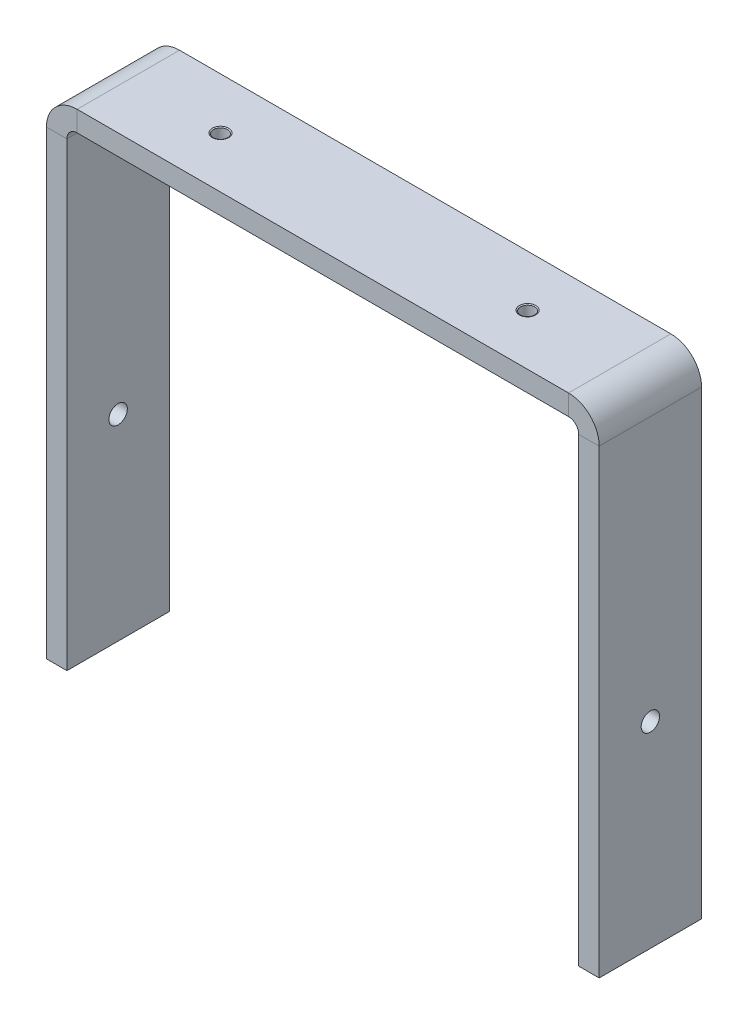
ISO-10303-21;
HEADER;
FILE_DESCRIPTION(('STEP AP214'),'2;1');
FILE_NAME('part.step','',(''),(''),'','','');
FILE_SCHEMA(('AUTOMOTIVE_DESIGN { 1 0 10303 214 1 1 1 1 }'));
ENDSEC;
DATA;
#1=APPLICATION_CONTEXT('core data for automotive mechanical design processes');
#2=APPLICATION_PROTOCOL_DEFINITION('international standard','automotive_design',2000,#1);
#3=PRODUCT_CONTEXT('',#1,'mechanical');
#4=PRODUCT('Part','Part','',(#3));
#5=PRODUCT_RELATED_PRODUCT_CATEGORY('part','',(#4));
#6=PRODUCT_DEFINITION_FORMATION('','',#4);
#7=PRODUCT_DEFINITION_CONTEXT('part definition',#1,'design');
#8=PRODUCT_DEFINITION('design','',#6,#7);
#9=PRODUCT_DEFINITION_SHAPE('','',#8);
#10=(LENGTH_UNIT() NAMED_UNIT(*) SI_UNIT(.MILLI.,.METRE.));
#11=(NAMED_UNIT(*) PLANE_ANGLE_UNIT() SI_UNIT($,.RADIAN.));
#12=(NAMED_UNIT(*) SI_UNIT($,.STERADIAN.) SOLID_ANGLE_UNIT());
#13=UNCERTAINTY_MEASURE_WITH_UNIT(LENGTH_MEASURE(1.E-05),#10,'distance_accuracy_value','');
#14=(GEOMETRIC_REPRESENTATION_CONTEXT(3) GLOBAL_UNCERTAINTY_ASSIGNED_CONTEXT((#13)) GLOBAL_UNIT_ASSIGNED_CONTEXT((#10,
#11,#12)) REPRESENTATION_CONTEXT('',''));
#15=CARTESIAN_POINT('',(0.,0.,0.));
#16=DIRECTION('',(0.,0.,1.));
#17=DIRECTION('',(1.,0.,0.));
#18=AXIS2_PLACEMENT_3D('',#15,#16,#17);
#19=CARTESIAN_POINT('',(135.,240.,25.));
#20=DIRECTION('',(1.,0.,0.));
#21=DIRECTION('',(0.,1.,0.));
#22=AXIS2_PLACEMENT_3D('',#19,#20,#21);
#23=PLANE('',#22);
#24=DIRECTION('',(0.,0.,-1.));
#25=VECTOR('',#24,1.);
#26=CARTESIAN_POINT('',(135.,225.,-25.));
#27=LINE('',#26,#25);
#28=CARTESIAN_POINT('',(135.,225.,25.));
#29=VERTEX_POINT('',#28);
#30=CARTESIAN_POINT('',(135.,225.,-25.));
#31=VERTEX_POINT('',#30);
#32=EDGE_CURVE('E209',#29,#31,#27,.T.);
#33=ORIENTED_EDGE('',*,*,#32,.F.);
#34=DIRECTION('',(0.,1.,0.));
#35=VECTOR('',#34,1.);
#36=CARTESIAN_POINT('',(135.,240.,25.));
#37=LINE('',#36,#35);
#38=CARTESIAN_POINT('',(135.,0.,25.));
#39=VERTEX_POINT('',#38);
#40=EDGE_CURVE('E11',#39,#29,#37,.T.);
#41=ORIENTED_EDGE('',*,*,#40,.F.);
#42=DIRECTION('',(0.,0.,-1.));
#43=VECTOR('',#42,1.);
#44=CARTESIAN_POINT('',(135.,0.,25.));
#45=LINE('',#44,#43);
#46=CARTESIAN_POINT('',(135.,0.,-25.));
#47=VERTEX_POINT('',#46);
#48=EDGE_CURVE('E204',#39,#47,#45,.T.);
#49=ORIENTED_EDGE('',*,*,#48,.T.);
#50=DIRECTION('',(0.,-1.,0.));
#51=VECTOR('',#50,1.);
#52=CARTESIAN_POINT('',(135.,240.,-25.));
#53=LINE('',#52,#51);
#54=EDGE_CURVE('E201',#31,#47,#53,.T.);
#55=ORIENTED_EDGE('',*,*,#54,.F.);
#56=EDGE_LOOP('',(#33,#41,#49,#55));
#57=FACE_BOUND('',#56,.T.);
#58=CARTESIAN_POINT('',(135.,96.,0.));
#59=DIRECTION('',(1.,0.,0.));
#60=DIRECTION('',(0.,0.,-1.));
#61=AXIS2_PLACEMENT_3D('',#58,#59,#60);
#62=CIRCLE('',#61,4.5);
#63=CARTESIAN_POINT('',(135.,96.,-4.5));
#64=VERTEX_POINT('',#63);
#65=EDGE_CURVE('E198',#64,#64,#62,.T.);
#66=ORIENTED_EDGE('',*,*,#65,.F.);
#67=EDGE_LOOP('',(#66));
#68=FACE_BOUND('',#67,.T.);
#69=ADVANCED_FACE('F28',(#57,#68),#23,.T.);
#70=CARTESIAN_POINT('',(-135.,96.0000000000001,0.));
#71=DIRECTION('',(1.,0.,0.));
#72=DIRECTION('',(0.,0.,-1.));
#73=AXIS2_PLACEMENT_3D('',#70,#71,#72);
#74=CYLINDRICAL_SURFACE('',#73,4.5);
#75=ORIENTED_EDGE('',*,*,#65,.T.);
#76=EDGE_LOOP('',(#75));
#77=FACE_BOUND('',#76,.T.);
#78=CARTESIAN_POINT('',(125.,96.,0.));
#79=DIRECTION('',(1.,0.,0.));
#80=DIRECTION('',(0.,1.,0.));
#81=AXIS2_PLACEMENT_3D('',#78,#79,#80);
#82=CIRCLE('',#81,4.5);
#83=CARTESIAN_POINT('',(125.,100.5,0.));
#84=VERTEX_POINT('',#83);
#85=EDGE_CURVE('E191',#84,#84,#82,.T.);
#86=ORIENTED_EDGE('',*,*,#85,.F.);
#87=EDGE_LOOP('',(#86));
#88=FACE_BOUND('',#87,.T.);
#89=ADVANCED_FACE('F311',(#77,#88),#74,.F.);
#90=CARTESIAN_POINT('',(125.,240.,25.));
#91=DIRECTION('',(1.,0.,0.));
#92=DIRECTION('',(0.,1.,0.));
#93=AXIS2_PLACEMENT_3D('',#90,#91,#92);
#94=PLANE('',#93);
#95=ORIENTED_EDGE('',*,*,#85,.T.);
#96=EDGE_LOOP('',(#95));
#97=FACE_BOUND('',#96,.T.);
#98=DIRECTION('',(0.,1.,0.));
#99=VECTOR('',#98,1.);
#100=CARTESIAN_POINT('',(125.,240.,25.));
#101=LINE('',#100,#99);
#102=CARTESIAN_POINT('',(125.,0.,25.));
#103=VERTEX_POINT('',#102);
#104=CARTESIAN_POINT('',(125.,225.,25.));
#105=VERTEX_POINT('',#104);
#106=EDGE_CURVE('E36',#103,#105,#101,.T.);
#107=ORIENTED_EDGE('',*,*,#106,.T.);
#108=DIRECTION('',(0.,0.,-1.));
#109=VECTOR('',#108,1.);
#110=CARTESIAN_POINT('',(125.,225.,-25.));
#111=LINE('',#110,#109);
#112=CARTESIAN_POINT('',(125.,225.,-25.));
#113=VERTEX_POINT('',#112);
#114=EDGE_CURVE('E206',#105,#113,#111,.T.);
#115=ORIENTED_EDGE('',*,*,#114,.T.);
#116=DIRECTION('',(0.,-1.,0.));
#117=VECTOR('',#116,1.);
#118=CARTESIAN_POINT('',(125.,240.,-25.));
#119=LINE('',#118,#117);
#120=CARTESIAN_POINT('',(125.,0.,-25.));
#121=VERTEX_POINT('',#120);
#122=EDGE_CURVE('E194',#113,#121,#119,.T.);
#123=ORIENTED_EDGE('',*,*,#122,.T.);
#124=DIRECTION('',(0.,0.,-1.));
#125=VECTOR('',#124,1.);
#126=CARTESIAN_POINT('',(125.,0.,25.));
#127=LINE('',#126,#125);
#128=EDGE_CURVE('E43',#103,#121,#127,.T.);
#129=ORIENTED_EDGE('',*,*,#128,.F.);
#130=EDGE_LOOP('',(#107,#115,#123,#129));
#131=FACE_BOUND('',#130,.T.);
#132=ADVANCED_FACE('F219',(#97,#131),#94,.F.);
#133=CARTESIAN_POINT('',(-335.977222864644,240.,-25.));
#134=DIRECTION('',(0.,0.,1.));
#135=DIRECTION('',(-1.,0.,0.));
#136=AXIS2_PLACEMENT_3D('',#133,#134,#135);
#137=PLANE('',#136);
#138=ORIENTED_EDGE('',*,*,#54,.T.);
#139=DIRECTION('',(1.,0.,0.));
#140=VECTOR('',#139,1.);
#141=CARTESIAN_POINT('',(-335.977222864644,0.,-25.));
#142=LINE('',#141,#140);
#143=EDGE_CURVE('E216',#121,#47,#142,.T.);
#144=ORIENTED_EDGE('',*,*,#143,.F.);
#145=ORIENTED_EDGE('',*,*,#122,.F.);
#146=DIRECTION('',(1.,0.,0.));
#147=VECTOR('',#146,1.);
#148=CARTESIAN_POINT('',(-335.977222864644,225.,-25.));
#149=LINE('',#148,#147);
#150=EDGE_CURVE('E125',#113,#31,#149,.T.);
#151=ORIENTED_EDGE('',*,*,#150,.T.);
#152=EDGE_LOOP('',(#138,#144,#145,#151));
#153=FACE_BOUND('',#152,.T.);
#154=ADVANCED_FACE('F30',(#153),#137,.F.);
#155=CARTESIAN_POINT('',(-335.977222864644,0.,25.));
#156=DIRECTION('',(0.,-1.,0.));
#157=DIRECTION('',(1.,0.,0.));
#158=AXIS2_PLACEMENT_3D('',#155,#156,#157);
#159=PLANE('',#158);
#160=ORIENTED_EDGE('',*,*,#143,.T.);
#161=ORIENTED_EDGE('',*,*,#48,.F.);
#162=DIRECTION('',(1.,0.,0.));
#163=VECTOR('',#162,1.);
#164=CARTESIAN_POINT('',(-335.977222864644,0.,25.));
#165=LINE('',#164,#163);
#166=EDGE_CURVE('E214',#103,#39,#165,.T.);
#167=ORIENTED_EDGE('',*,*,#166,.F.);
#168=ORIENTED_EDGE('',*,*,#128,.T.);
#169=EDGE_LOOP('',(#160,#161,#167,#168));
#170=FACE_BOUND('',#169,.T.);
#171=ADVANCED_FACE('F223',(#170),#159,.T.);
#172=CARTESIAN_POINT('',(-335.977222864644,240.,25.));
#173=DIRECTION('',(0.,0.,1.));
#174=DIRECTION('',(-1.,0.,0.));
#175=AXIS2_PLACEMENT_3D('',#172,#173,#174);
#176=PLANE('',#175);
#177=ORIENTED_EDGE('',*,*,#166,.T.);
#178=ORIENTED_EDGE('',*,*,#40,.T.);
#179=DIRECTION('',(1.,0.,0.));
#180=VECTOR('',#179,1.);
#181=CARTESIAN_POINT('',(-335.977222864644,225.,25.));
#182=LINE('',#181,#180);
#183=EDGE_CURVE('E212',#105,#29,#182,.T.);
#184=ORIENTED_EDGE('',*,*,#183,.F.);
#185=ORIENTED_EDGE('',*,*,#106,.F.);
#186=EDGE_LOOP('',(#177,#178,#184,#185));
#187=FACE_BOUND('',#186,.T.);
#188=ADVANCED_FACE('F225',(#187),#176,.T.);
#189=CARTESIAN_POINT('',(-135.,240.,25.));
#190=DIRECTION('',(0.,1.,0.));
#191=DIRECTION('',(-1.,0.,0.));
#192=AXIS2_PLACEMENT_3D('',#189,#190,#191);
#193=PLANE('',#192);
#194=CARTESIAN_POINT('',(-75.0000000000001,240.,0.));
#195=DIRECTION('',(0.,1.,0.));
#196=DIRECTION('',(-1.,0.,0.));
#197=AXIS2_PLACEMENT_3D('',#194,#195,#196);
#198=CIRCLE('',#197,4.00000000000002);
#199=CARTESIAN_POINT('',(-79.0000000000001,240.,0.));
#200=VERTEX_POINT('',#199);
#201=EDGE_CURVE('E171',#200,#200,#198,.F.);
#202=ORIENTED_EDGE('',*,*,#201,.T.);
#203=EDGE_LOOP('',(#202));
#204=FACE_BOUND('',#203,.T.);
#205=CARTESIAN_POINT('',(74.9999999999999,240.,0.));
#206=DIRECTION('',(0.,1.,0.));
#207=DIRECTION('',(-1.,0.,0.));
#208=AXIS2_PLACEMENT_3D('',#205,#206,#207);
#209=CIRCLE('',#208,3.99999999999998);
#210=CARTESIAN_POINT('',(70.9999999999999,240.,0.));
#211=VERTEX_POINT('',#210);
#212=EDGE_CURVE('E168',#211,#211,#209,.F.);
#213=ORIENTED_EDGE('',*,*,#212,.T.);
#214=EDGE_LOOP('',(#213));
#215=FACE_BOUND('',#214,.T.);
#216=DIRECTION('',(1.,0.,0.));
#217=VECTOR('',#216,1.);
#218=CARTESIAN_POINT('',(-135.,240.,25.));
#219=LINE('',#218,#217);
#220=CARTESIAN_POINT('',(-120.,240.,25.));
#221=VERTEX_POINT('',#220);
#222=CARTESIAN_POINT('',(120.,240.,25.));
#223=VERTEX_POINT('',#222);
#224=EDGE_CURVE('E175',#221,#223,#219,.T.);
#225=ORIENTED_EDGE('',*,*,#224,.T.);
#226=DIRECTION('',(0.,0.,-1.));
#227=VECTOR('',#226,1.);
#228=CARTESIAN_POINT('',(120.,240.,-25.));
#229=LINE('',#228,#227);
#230=CARTESIAN_POINT('',(120.,240.,-25.));
#231=VERTEX_POINT('',#230);
#232=EDGE_CURVE('E139',#223,#231,#229,.T.);
#233=ORIENTED_EDGE('',*,*,#232,.T.);
#234=DIRECTION('',(1.,0.,0.));
#235=VECTOR('',#234,1.);
#236=CARTESIAN_POINT('',(-135.,240.,-25.));
#237=LINE('',#236,#235);
#238=CARTESIAN_POINT('',(-120.,240.,-25.));
#239=VERTEX_POINT('',#238);
#240=EDGE_CURVE('E150',#239,#231,#237,.T.);
#241=ORIENTED_EDGE('',*,*,#240,.F.);
#242=DIRECTION('',(0.,0.,-1.));
#243=VECTOR('',#242,1.);
#244=CARTESIAN_POINT('',(-120.,240.,-25.));
#245=LINE('',#244,#243);
#246=EDGE_CURVE('E188',#221,#239,#245,.T.);
#247=ORIENTED_EDGE('',*,*,#246,.F.);
#248=EDGE_LOOP('',(#225,#233,#241,#247));
#249=FACE_BOUND('',#248,.T.);
#250=ADVANCED_FACE('F308',(#204,#215,#249),#193,.T.);
#251=CARTESIAN_POINT('',(-135.,230.,25.));
#252=DIRECTION('',(0.,1.,0.));
#253=DIRECTION('',(-1.,0.,0.));
#254=AXIS2_PLACEMENT_3D('',#251,#252,#253);
#255=PLANE('',#254);
#256=CARTESIAN_POINT('',(-75.0000000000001,230.,0.));
#257=DIRECTION('',(0.,1.,0.));
#258=DIRECTION('',(-1.,0.,0.));
#259=AXIS2_PLACEMENT_3D('',#256,#257,#258);
#260=CIRCLE('',#259,3.45);
#261=CARTESIAN_POINT('',(-78.4500000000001,230.,0.));
#262=VERTEX_POINT('',#261);
#263=EDGE_CURVE('E157',#262,#262,#260,.T.);
#264=ORIENTED_EDGE('',*,*,#263,.T.);
#265=EDGE_LOOP('',(#264));
#266=FACE_BOUND('',#265,.T.);
#267=CARTESIAN_POINT('',(74.9999999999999,230.,0.));
#268=DIRECTION('',(0.,1.,0.));
#269=DIRECTION('',(-1.,0.,0.));
#270=AXIS2_PLACEMENT_3D('',#267,#268,#269);
#271=CIRCLE('',#270,3.45);
#272=CARTESIAN_POINT('',(71.5499999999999,230.,0.));
#273=VERTEX_POINT('',#272);
#274=EDGE_CURVE('E162',#273,#273,#271,.T.);
#275=ORIENTED_EDGE('',*,*,#274,.T.);
#276=EDGE_LOOP('',(#275));
#277=FACE_BOUND('',#276,.T.);
#278=DIRECTION('',(0.,0.,-1.));
#279=VECTOR('',#278,1.);
#280=CARTESIAN_POINT('',(120.,230.,-25.));
#281=LINE('',#280,#279);
#282=CARTESIAN_POINT('',(120.,230.,25.));
#283=VERTEX_POINT('',#282);
#284=CARTESIAN_POINT('',(120.,230.,-25.));
#285=VERTEX_POINT('',#284);
#286=EDGE_CURVE('E132',#283,#285,#281,.T.);
#287=ORIENTED_EDGE('',*,*,#286,.F.);
#288=DIRECTION('',(1.,0.,0.));
#289=VECTOR('',#288,1.);
#290=CARTESIAN_POINT('',(-135.,230.,25.));
#291=LINE('',#290,#289);
#292=CARTESIAN_POINT('',(-120.,230.,25.));
#293=VERTEX_POINT('',#292);
#294=EDGE_CURVE('E156',#293,#283,#291,.T.);
#295=ORIENTED_EDGE('',*,*,#294,.F.);
#296=DIRECTION('',(0.,0.,-1.));
#297=VECTOR('',#296,1.);
#298=CARTESIAN_POINT('',(-120.,230.,-25.));
#299=LINE('',#298,#297);
#300=CARTESIAN_POINT('',(-120.,230.,-25.));
#301=VERTEX_POINT('',#300);
#302=EDGE_CURVE('E152',#293,#301,#299,.T.);
#303=ORIENTED_EDGE('',*,*,#302,.T.);
#304=DIRECTION('',(1.,0.,0.));
#305=VECTOR('',#304,1.);
#306=CARTESIAN_POINT('',(-135.,230.,-25.));
#307=LINE('',#306,#305);
#308=EDGE_CURVE('E147',#301,#285,#307,.T.);
#309=ORIENTED_EDGE('',*,*,#308,.T.);
#310=EDGE_LOOP('',(#287,#295,#303,#309));
#311=FACE_BOUND('',#310,.T.);
#312=ADVANCED_FACE('F155',(#266,#277,#311),#255,.F.);
#313=CARTESIAN_POINT('',(-75.,0.,0.));
#314=DIRECTION('',(0.,1.,0.));
#315=DIRECTION('',(-1.,0.,0.));
#316=AXIS2_PLACEMENT_3D('',#313,#314,#315);
#317=CYLINDRICAL_SURFACE('',#316,3.45);
#318=CARTESIAN_POINT('',(-75.0000000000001,239.682457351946,0.));
#319=DIRECTION('',(0.,1.,0.));
#320=DIRECTION('',(0.,0.,1.));
#321=AXIS2_PLACEMENT_3D('',#318,#319,#320);
#322=CIRCLE('',#321,3.45);
#323=CARTESIAN_POINT('',(-75.0000000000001,239.682457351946,3.45));
#324=VERTEX_POINT('',#323);
#325=EDGE_CURVE('E140',#324,#324,#322,.T.);
#326=ORIENTED_EDGE('',*,*,#325,.T.);
#327=EDGE_LOOP('',(#326));
#328=FACE_BOUND('',#327,.T.);
#329=ORIENTED_EDGE('',*,*,#263,.F.);
#330=EDGE_LOOP('',(#329));
#331=FACE_BOUND('',#330,.T.);
#332=ADVANCED_FACE('F302',(#328,#331),#317,.F.);
#333=CARTESIAN_POINT('',(-75.0000000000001,239.682457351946,0.));
#334=DIRECTION('',(0.,1.,0.));
#335=DIRECTION('',(0.,0.,1.));
#336=AXIS2_PLACEMENT_3D('',#333,#334,#335);
#337=CONICAL_SURFACE('',#336,3.45,1.04719755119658);
#338=ORIENTED_EDGE('',*,*,#201,.F.);
#339=EDGE_LOOP('',(#338));
#340=FACE_BOUND('',#339,.T.);
#341=ORIENTED_EDGE('',*,*,#325,.F.);
#342=EDGE_LOOP('',(#341));
#343=FACE_BOUND('',#342,.T.);
#344=ADVANCED_FACE('F303',(#340,#343),#337,.F.);
#345=CARTESIAN_POINT('',(74.9999999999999,239.682457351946,0.));
#346=DIRECTION('',(0.,1.,0.));
#347=DIRECTION('',(0.,0.,1.));
#348=AXIS2_PLACEMENT_3D('',#345,#346,#347);
#349=CONICAL_SURFACE('',#348,3.45,1.04719755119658);
#350=ORIENTED_EDGE('',*,*,#212,.F.);
#351=EDGE_LOOP('',(#350));
#352=FACE_BOUND('',#351,.T.);
#353=CARTESIAN_POINT('',(74.9999999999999,239.682457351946,0.));
#354=DIRECTION('',(0.,1.,0.));
#355=DIRECTION('',(0.,0.,1.));
#356=AXIS2_PLACEMENT_3D('',#353,#354,#355);
#357=CIRCLE('',#356,3.45);
#358=CARTESIAN_POINT('',(74.9999999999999,239.682457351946,3.45));
#359=VERTEX_POINT('',#358);
#360=EDGE_CURVE('E159',#359,#359,#357,.T.);
#361=ORIENTED_EDGE('',*,*,#360,.F.);
#362=EDGE_LOOP('',(#361));
#363=FACE_BOUND('',#362,.T.);
#364=ADVANCED_FACE('F293',(#352,#363),#349,.F.);
#365=CARTESIAN_POINT('',(75.,0.,0.));
#366=DIRECTION('',(0.,1.,0.));
#367=DIRECTION('',(-1.,0.,0.));
#368=AXIS2_PLACEMENT_3D('',#365,#366,#367);
#369=CYLINDRICAL_SURFACE('',#368,3.45);
#370=ORIENTED_EDGE('',*,*,#360,.T.);
#371=EDGE_LOOP('',(#370));
#372=FACE_BOUND('',#371,.T.);
#373=ORIENTED_EDGE('',*,*,#274,.F.);
#374=EDGE_LOOP('',(#373));
#375=FACE_BOUND('',#374,.T.);
#376=ADVANCED_FACE('F291',(#372,#375),#369,.F.);
#377=CARTESIAN_POINT('',(-135.,-260.30602688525,-25.));
#378=DIRECTION('',(0.,0.,1.));
#379=DIRECTION('',(0.,-1.,0.));
#380=AXIS2_PLACEMENT_3D('',#377,#378,#379);
#381=PLANE('',#380);
#382=ORIENTED_EDGE('',*,*,#240,.T.);
#383=DIRECTION('',(0.,1.,0.));
#384=VECTOR('',#383,1.);
#385=CARTESIAN_POINT('',(120.,-260.30602688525,-25.));
#386=LINE('',#385,#384);
#387=EDGE_CURVE('E122',#285,#231,#386,.T.);
#388=ORIENTED_EDGE('',*,*,#387,.F.);
#389=ORIENTED_EDGE('',*,*,#308,.F.);
#390=DIRECTION('',(0.,1.,0.));
#391=VECTOR('',#390,1.);
#392=CARTESIAN_POINT('',(-120.,-260.30602688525,-25.));
#393=LINE('',#392,#391);
#394=EDGE_CURVE('E181',#301,#239,#393,.T.);
#395=ORIENTED_EDGE('',*,*,#394,.T.);
#396=EDGE_LOOP('',(#382,#388,#389,#395));
#397=FACE_BOUND('',#396,.T.);
#398=ADVANCED_FACE('F145',(#397),#381,.F.);
#399=CARTESIAN_POINT('',(-135.,-260.30602688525,25.));
#400=DIRECTION('',(0.,0.,1.));
#401=DIRECTION('',(0.,-1.,0.));
#402=AXIS2_PLACEMENT_3D('',#399,#400,#401);
#403=PLANE('',#402);
#404=DIRECTION('',(0.,1.,0.));
#405=VECTOR('',#404,1.);
#406=CARTESIAN_POINT('',(120.,-260.30602688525,25.));
#407=LINE('',#406,#405);
#408=EDGE_CURVE('E153',#283,#223,#407,.T.);
#409=ORIENTED_EDGE('',*,*,#408,.T.);
#410=ORIENTED_EDGE('',*,*,#224,.F.);
#411=DIRECTION('',(0.,1.,0.));
#412=VECTOR('',#411,1.);
#413=CARTESIAN_POINT('',(-120.,-260.30602688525,25.));
#414=LINE('',#413,#412);
#415=EDGE_CURVE('E183',#293,#221,#414,.T.);
#416=ORIENTED_EDGE('',*,*,#415,.F.);
#417=ORIENTED_EDGE('',*,*,#294,.T.);
#418=EDGE_LOOP('',(#409,#410,#416,#417));
#419=FACE_BOUND('',#418,.T.);
#420=ADVANCED_FACE('F300',(#419),#403,.T.);
#421=CARTESIAN_POINT('',(-135.,0.,25.));
#422=DIRECTION('',(-1.,0.,0.));
#423=DIRECTION('',(0.,0.,1.));
#424=AXIS2_PLACEMENT_3D('',#421,#422,#423);
#425=PLANE('',#424);
#426=CARTESIAN_POINT('',(-135.,96.,0.));
#427=DIRECTION('',(1.,0.,0.));
#428=DIRECTION('',(0.,0.,-1.));
#429=AXIS2_PLACEMENT_3D('',#426,#427,#428);
#430=CIRCLE('',#429,4.5);
#431=CARTESIAN_POINT('',(-135.,96.,-4.5));
#432=VERTEX_POINT('',#431);
#433=EDGE_CURVE('E261',#432,#432,#430,.T.);
#434=ORIENTED_EDGE('',*,*,#433,.T.);
#435=EDGE_LOOP('',(#434));
#436=FACE_BOUND('',#435,.T.);
#437=DIRECTION('',(0.,1.,0.));
#438=VECTOR('',#437,1.);
#439=CARTESIAN_POINT('',(-135.,0.,25.));
#440=LINE('',#439,#438);
#441=CARTESIAN_POINT('',(-135.,0.,25.));
#442=VERTEX_POINT('',#441);
#443=CARTESIAN_POINT('',(-135.,225.,25.));
#444=VERTEX_POINT('',#443);
#445=EDGE_CURVE('E269',#442,#444,#440,.T.);
#446=ORIENTED_EDGE('',*,*,#445,.T.);
#447=DIRECTION('',(0.,0.,-1.));
#448=VECTOR('',#447,1.);
#449=CARTESIAN_POINT('',(-135.,225.,-25.));
#450=LINE('',#449,#448);
#451=CARTESIAN_POINT('',(-135.,225.,-25.));
#452=VERTEX_POINT('',#451);
#453=EDGE_CURVE('E275',#444,#452,#450,.T.);
#454=ORIENTED_EDGE('',*,*,#453,.T.);
#455=DIRECTION('',(0.,1.,0.));
#456=VECTOR('',#455,1.);
#457=CARTESIAN_POINT('',(-135.,0.,-25.));
#458=LINE('',#457,#456);
#459=CARTESIAN_POINT('',(-135.,0.,-25.));
#460=VERTEX_POINT('',#459);
#461=EDGE_CURVE('E264',#460,#452,#458,.T.);
#462=ORIENTED_EDGE('',*,*,#461,.F.);
#463=DIRECTION('',(0.,0.,-1.));
#464=VECTOR('',#463,1.);
#465=CARTESIAN_POINT('',(-135.,0.,25.));
#466=LINE('',#465,#464);
#467=EDGE_CURVE('E267',#442,#460,#466,.T.);
#468=ORIENTED_EDGE('',*,*,#467,.F.);
#469=EDGE_LOOP('',(#446,#454,#462,#468));
#470=FACE_BOUND('',#469,.T.);
#471=ADVANCED_FACE('F377',(#436,#470),#425,.T.);
#472=CARTESIAN_POINT('',(-125.,0.,25.));
#473=DIRECTION('',(-1.,0.,0.));
#474=DIRECTION('',(0.,0.,1.));
#475=AXIS2_PLACEMENT_3D('',#472,#473,#474);
#476=PLANE('',#475);
#477=CARTESIAN_POINT('',(-125.,96.,0.));
#478=DIRECTION('',(-1.,0.,0.));
#479=DIRECTION('',(0.,0.,1.));
#480=AXIS2_PLACEMENT_3D('',#477,#478,#479);
#481=CIRCLE('',#480,4.5);
#482=CARTESIAN_POINT('',(-125.,96.,4.5));
#483=VERTEX_POINT('',#482);
#484=EDGE_CURVE('E250',#483,#483,#481,.T.);
#485=ORIENTED_EDGE('',*,*,#484,.T.);
#486=EDGE_LOOP('',(#485));
#487=FACE_BOUND('',#486,.T.);
#488=DIRECTION('',(0.,0.,-1.));
#489=VECTOR('',#488,1.);
#490=CARTESIAN_POINT('',(-125.,225.,-25.));
#491=LINE('',#490,#489);
#492=CARTESIAN_POINT('',(-125.,225.,25.));
#493=VERTEX_POINT('',#492);
#494=CARTESIAN_POINT('',(-125.,225.,-25.));
#495=VERTEX_POINT('',#494);
#496=EDGE_CURVE('E272',#493,#495,#491,.T.);
#497=ORIENTED_EDGE('',*,*,#496,.F.);
#498=DIRECTION('',(0.,1.,0.));
#499=VECTOR('',#498,1.);
#500=CARTESIAN_POINT('',(-125.,0.,25.));
#501=LINE('',#500,#499);
#502=CARTESIAN_POINT('',(-125.,0.,25.));
#503=VERTEX_POINT('',#502);
#504=EDGE_CURVE('E256',#503,#493,#501,.T.);
#505=ORIENTED_EDGE('',*,*,#504,.F.);
#506=DIRECTION('',(0.,0.,-1.));
#507=VECTOR('',#506,1.);
#508=CARTESIAN_POINT('',(-125.,0.,25.));
#509=LINE('',#508,#507);
#510=CARTESIAN_POINT('',(-125.,0.,-25.));
#511=VERTEX_POINT('',#510);
#512=EDGE_CURVE('E259',#503,#511,#509,.T.);
#513=ORIENTED_EDGE('',*,*,#512,.T.);
#514=DIRECTION('',(0.,1.,0.));
#515=VECTOR('',#514,1.);
#516=CARTESIAN_POINT('',(-125.,0.,-25.));
#517=LINE('',#516,#515);
#518=EDGE_CURVE('E253',#511,#495,#517,.T.);
#519=ORIENTED_EDGE('',*,*,#518,.T.);
#520=EDGE_LOOP('',(#497,#505,#513,#519));
#521=FACE_BOUND('',#520,.T.);
#522=ADVANCED_FACE('F384',(#487,#521),#476,.F.);
#523=CARTESIAN_POINT('',(-135.,96.,0.));
#524=DIRECTION('',(1.,0.,0.));
#525=DIRECTION('',(0.,0.,-1.));
#526=AXIS2_PLACEMENT_3D('',#523,#524,#525);
#527=CYLINDRICAL_SURFACE('',#526,4.5);
#528=ORIENTED_EDGE('',*,*,#433,.F.);
#529=EDGE_LOOP('',(#528));
#530=FACE_BOUND('',#529,.T.);
#531=ORIENTED_EDGE('',*,*,#484,.F.);
#532=EDGE_LOOP('',(#531));
#533=FACE_BOUND('',#532,.T.);
#534=ADVANCED_FACE('F392',(#530,#533),#527,.F.);
#535=CARTESIAN_POINT('',(335.977222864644,0.,-25.));
#536=DIRECTION('',(0.,0.,1.));
#537=DIRECTION('',(1.,0.,0.));
#538=AXIS2_PLACEMENT_3D('',#535,#536,#537);
#539=PLANE('',#538);
#540=ORIENTED_EDGE('',*,*,#461,.T.);
#541=DIRECTION('',(-1.,0.,0.));
#542=VECTOR('',#541,1.);
#543=CARTESIAN_POINT('',(335.977222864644,225.,-25.));
#544=LINE('',#543,#542);
#545=EDGE_CURVE('E286',#495,#452,#544,.T.);
#546=ORIENTED_EDGE('',*,*,#545,.F.);
#547=ORIENTED_EDGE('',*,*,#518,.F.);
#548=DIRECTION('',(-1.,0.,0.));
#549=VECTOR('',#548,1.);
#550=CARTESIAN_POINT('',(335.977222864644,0.,-25.));
#551=LINE('',#550,#549);
#552=EDGE_CURVE('E278',#511,#460,#551,.T.);
#553=ORIENTED_EDGE('',*,*,#552,.T.);
#554=EDGE_LOOP('',(#540,#546,#547,#553));
#555=FACE_BOUND('',#554,.T.);
#556=ADVANCED_FACE('F400',(#555),#539,.F.);
#557=CARTESIAN_POINT('',(335.977222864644,0.,25.));
#558=DIRECTION('',(0.,0.,1.));
#559=DIRECTION('',(1.,0.,0.));
#560=AXIS2_PLACEMENT_3D('',#557,#558,#559);
#561=PLANE('',#560);
#562=DIRECTION('',(-1.,0.,0.));
#563=VECTOR('',#562,1.);
#564=CARTESIAN_POINT('',(335.977222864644,225.,25.));
#565=LINE('',#564,#563);
#566=EDGE_CURVE('E283',#493,#444,#565,.T.);
#567=ORIENTED_EDGE('',*,*,#566,.T.);
#568=ORIENTED_EDGE('',*,*,#445,.F.);
#569=DIRECTION('',(-1.,0.,0.));
#570=VECTOR('',#569,1.);
#571=CARTESIAN_POINT('',(335.977222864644,0.,25.));
#572=LINE('',#571,#570);
#573=EDGE_CURVE('E281',#503,#442,#572,.T.);
#574=ORIENTED_EDGE('',*,*,#573,.F.);
#575=ORIENTED_EDGE('',*,*,#504,.T.);
#576=EDGE_LOOP('',(#567,#568,#574,#575));
#577=FACE_BOUND('',#576,.T.);
#578=ADVANCED_FACE('F408',(#577),#561,.T.);
#579=CARTESIAN_POINT('',(335.977222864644,0.,25.));
#580=DIRECTION('',(0.,1.,0.));
#581=DIRECTION('',(0.,0.,1.));
#582=AXIS2_PLACEMENT_3D('',#579,#580,#581);
#583=PLANE('',#582);
#584=ORIENTED_EDGE('',*,*,#467,.T.);
#585=ORIENTED_EDGE('',*,*,#552,.F.);
#586=ORIENTED_EDGE('',*,*,#512,.F.);
#587=ORIENTED_EDGE('',*,*,#573,.T.);
#588=EDGE_LOOP('',(#584,#585,#586,#587));
#589=FACE_BOUND('',#588,.T.);
#590=ADVANCED_FACE('F416',(#589),#583,.F.);
#591=CARTESIAN_POINT('',(-120.,225.,-25.));
#592=DIRECTION('',(0.,0.,-1.));
#593=DIRECTION('',(-1.,0.,0.));
#594=AXIS2_PLACEMENT_3D('',#591,#592,#593);
#595=PLANE('',#594);
#596=ORIENTED_EDGE('',*,*,#394,.F.);
#597=CARTESIAN_POINT('',(-120.,225.,-25.));
#598=DIRECTION('',(0.,0.,1.));
#599=DIRECTION('',(1.,0.,0.));
#600=AXIS2_PLACEMENT_3D('',#597,#598,#599);
#601=CIRCLE('',#600,5.00000000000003);
#602=EDGE_CURVE('E235',#301,#495,#601,.T.);
#603=ORIENTED_EDGE('',*,*,#602,.T.);
#604=ORIENTED_EDGE('',*,*,#545,.T.);
#605=CARTESIAN_POINT('',(-120.,225.,-25.));
#606=DIRECTION('',(0.,0.,1.));
#607=DIRECTION('',(1.,0.,0.));
#608=AXIS2_PLACEMENT_3D('',#605,#606,#607);
#609=CIRCLE('',#608,15.);
#610=EDGE_CURVE('E244',#239,#452,#609,.T.);
#611=ORIENTED_EDGE('',*,*,#610,.F.);
#612=EDGE_LOOP('',(#596,#603,#604,#611));
#613=FACE_BOUND('',#612,.T.);
#614=ADVANCED_FACE('F424',(#613),#595,.T.);
#615=CARTESIAN_POINT('',(-120.,225.,25.));
#616=DIRECTION('',(0.,0.,1.));
#617=DIRECTION('',(1.,0.,0.));
#618=AXIS2_PLACEMENT_3D('',#615,#616,#617);
#619=PLANE('',#618);
#620=CARTESIAN_POINT('',(-120.,225.,25.));
#621=DIRECTION('',(0.,0.,1.));
#622=DIRECTION('',(1.,0.,0.));
#623=AXIS2_PLACEMENT_3D('',#620,#621,#622);
#624=CIRCLE('',#623,5.00000000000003);
#625=EDGE_CURVE('E237',#493,#293,#624,.F.);
#626=ORIENTED_EDGE('',*,*,#625,.T.);
#627=ORIENTED_EDGE('',*,*,#415,.T.);
#628=CARTESIAN_POINT('',(-120.,225.,25.));
#629=DIRECTION('',(0.,0.,1.));
#630=DIRECTION('',(1.,0.,0.));
#631=AXIS2_PLACEMENT_3D('',#628,#629,#630);
#632=CIRCLE('',#631,15.);
#633=EDGE_CURVE('E247',#444,#221,#632,.F.);
#634=ORIENTED_EDGE('',*,*,#633,.F.);
#635=ORIENTED_EDGE('',*,*,#566,.F.);
#636=EDGE_LOOP('',(#626,#627,#634,#635));
#637=FACE_BOUND('',#636,.T.);
#638=ADVANCED_FACE('F432',(#637),#619,.T.);
#639=CARTESIAN_POINT('',(-120.,225.,-748.215693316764));
#640=DIRECTION('',(0.,0.,1.));
#641=DIRECTION('',(1.,0.,0.));
#642=AXIS2_PLACEMENT_3D('',#639,#640,#641);
#643=CYLINDRICAL_SURFACE('',#642,15.);
#644=ORIENTED_EDGE('',*,*,#453,.F.);
#645=ORIENTED_EDGE('',*,*,#633,.T.);
#646=ORIENTED_EDGE('',*,*,#246,.T.);
#647=ORIENTED_EDGE('',*,*,#610,.T.);
#648=EDGE_LOOP('',(#644,#645,#646,#647));
#649=FACE_BOUND('',#648,.T.);
#650=ADVANCED_FACE('F435',(#649),#643,.T.);
#651=CARTESIAN_POINT('',(-120.,225.,-748.215693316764));
#652=DIRECTION('',(0.,0.,1.));
#653=DIRECTION('',(1.,0.,0.));
#654=AXIS2_PLACEMENT_3D('',#651,#652,#653);
#655=CYLINDRICAL_SURFACE('',#654,5.00000000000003);
#656=ORIENTED_EDGE('',*,*,#496,.T.);
#657=ORIENTED_EDGE('',*,*,#602,.F.);
#658=ORIENTED_EDGE('',*,*,#302,.F.);
#659=ORIENTED_EDGE('',*,*,#625,.F.);
#660=EDGE_LOOP('',(#656,#657,#658,#659));
#661=FACE_BOUND('',#660,.T.);
#662=ADVANCED_FACE('F443',(#661),#655,.F.);
#663=CARTESIAN_POINT('',(120.,225.,-25.));
#664=DIRECTION('',(0.,0.,-1.));
#665=DIRECTION('',(-1.,0.,0.));
#666=AXIS2_PLACEMENT_3D('',#663,#664,#665);
#667=PLANE('',#666);
#668=ORIENTED_EDGE('',*,*,#150,.F.);
#669=CARTESIAN_POINT('',(120.,225.,-25.));
#670=DIRECTION('',(0.,0.,1.));
#671=DIRECTION('',(1.,0.,0.));
#672=AXIS2_PLACEMENT_3D('',#669,#670,#671);
#673=CIRCLE('',#672,4.99999999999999);
#674=EDGE_CURVE('E118',#113,#285,#673,.T.);
#675=ORIENTED_EDGE('',*,*,#674,.T.);
#676=ORIENTED_EDGE('',*,*,#387,.T.);
#677=CARTESIAN_POINT('',(120.,225.,-25.));
#678=DIRECTION('',(0.,0.,1.));
#679=DIRECTION('',(1.,0.,0.));
#680=AXIS2_PLACEMENT_3D('',#677,#678,#679);
#681=CIRCLE('',#680,15.);
#682=EDGE_CURVE('E232',#31,#231,#681,.T.);
#683=ORIENTED_EDGE('',*,*,#682,.F.);
#684=EDGE_LOOP('',(#668,#675,#676,#683));
#685=FACE_BOUND('',#684,.T.);
#686=ADVANCED_FACE('F120',(#685),#667,.T.);
#687=CARTESIAN_POINT('',(120.,225.,25.));
#688=DIRECTION('',(0.,0.,1.));
#689=DIRECTION('',(1.,0.,0.));
#690=AXIS2_PLACEMENT_3D('',#687,#688,#689);
#691=PLANE('',#690);
#692=CARTESIAN_POINT('',(120.,225.,25.));
#693=DIRECTION('',(0.,0.,1.));
#694=DIRECTION('',(1.,0.,0.));
#695=AXIS2_PLACEMENT_3D('',#692,#693,#694);
#696=CIRCLE('',#695,4.99999999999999);
#697=EDGE_CURVE('E128',#283,#105,#696,.F.);
#698=ORIENTED_EDGE('',*,*,#697,.T.);
#699=ORIENTED_EDGE('',*,*,#183,.T.);
#700=CARTESIAN_POINT('',(120.,225.,25.));
#701=DIRECTION('',(0.,0.,1.));
#702=DIRECTION('',(1.,0.,0.));
#703=AXIS2_PLACEMENT_3D('',#700,#701,#702);
#704=CIRCLE('',#703,15.);
#705=EDGE_CURVE('E233',#223,#29,#704,.F.);
#706=ORIENTED_EDGE('',*,*,#705,.F.);
#707=ORIENTED_EDGE('',*,*,#408,.F.);
#708=EDGE_LOOP('',(#698,#699,#706,#707));
#709=FACE_BOUND('',#708,.T.);
#710=ADVANCED_FACE('F463',(#709),#691,.T.);
#711=CARTESIAN_POINT('',(120.,225.,-578.015718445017));
#712=DIRECTION('',(0.,0.,1.));
#713=DIRECTION('',(1.,0.,0.));
#714=AXIS2_PLACEMENT_3D('',#711,#712,#713);
#715=CYLINDRICAL_SURFACE('',#714,15.);
#716=ORIENTED_EDGE('',*,*,#232,.F.);
#717=ORIENTED_EDGE('',*,*,#705,.T.);
#718=ORIENTED_EDGE('',*,*,#32,.T.);
#719=ORIENTED_EDGE('',*,*,#682,.T.);
#720=EDGE_LOOP('',(#716,#717,#718,#719));
#721=FACE_BOUND('',#720,.T.);
#722=ADVANCED_FACE('F231',(#721),#715,.T.);
#723=CARTESIAN_POINT('',(120.,225.,-578.015718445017));
#724=DIRECTION('',(0.,0.,1.));
#725=DIRECTION('',(1.,0.,0.));
#726=AXIS2_PLACEMENT_3D('',#723,#724,#725);
#727=CYLINDRICAL_SURFACE('',#726,4.99999999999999);
#728=ORIENTED_EDGE('',*,*,#286,.T.);
#729=ORIENTED_EDGE('',*,*,#674,.F.);
#730=ORIENTED_EDGE('',*,*,#114,.F.);
#731=ORIENTED_EDGE('',*,*,#697,.F.);
#732=EDGE_LOOP('',(#728,#729,#730,#731));
#733=FACE_BOUND('',#732,.T.);
#734=ADVANCED_FACE('F133',(#733),#727,.F.);
#735=CLOSED_SHELL('',(#69,#89,#132,#154,#171,#188,#250,#312,#332,#344,#364,#376,#398,#420,#471,
#522,#534,#556,#578,#590,#614,#638,#650,#662,#686,#710,#722,#734));
#736=MANIFOLD_SOLID_BREP('B2',#735);
#737=ADVANCED_BREP_SHAPE_REPRESENTATION('',(#18,#736),#14);
#738=SHAPE_DEFINITION_REPRESENTATION(#9,#737);
ENDSEC;
END-ISO-10303-21;
